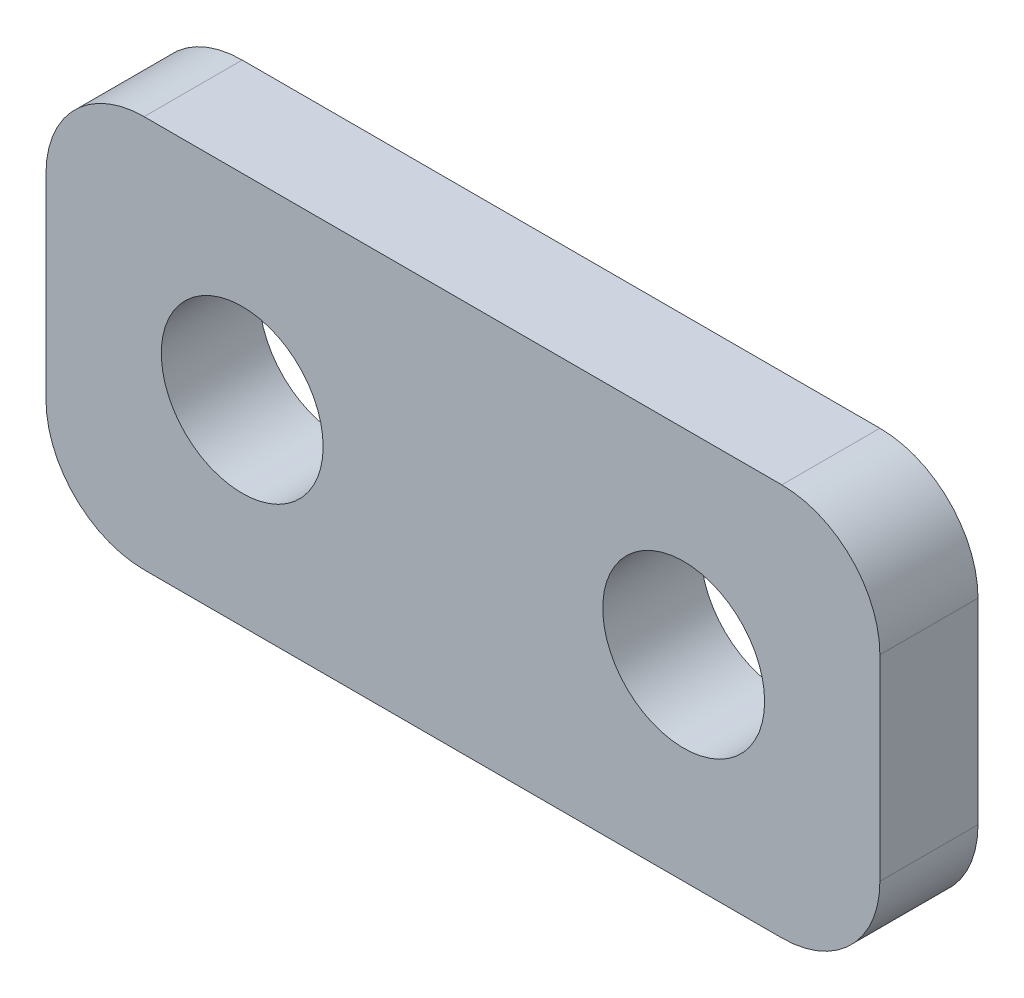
ISO-10303-21;
HEADER;
FILE_DESCRIPTION(('STEP AP214'),'2;1');
FILE_NAME('part.step','',(''),(''),'','','');
FILE_SCHEMA(('AUTOMOTIVE_DESIGN { 1 0 10303 214 1 1 1 1 }'));
ENDSEC;
DATA;
#1=APPLICATION_CONTEXT('core data for automotive mechanical design processes');
#2=APPLICATION_PROTOCOL_DEFINITION('international standard','automotive_design',2000,#1);
#3=PRODUCT_CONTEXT('',#1,'mechanical');
#4=PRODUCT('Part','Part','',(#3));
#5=PRODUCT_RELATED_PRODUCT_CATEGORY('part','',(#4));
#6=PRODUCT_DEFINITION_FORMATION('','',#4);
#7=PRODUCT_DEFINITION_CONTEXT('part definition',#1,'design');
#8=PRODUCT_DEFINITION('design','',#6,#7);
#9=PRODUCT_DEFINITION_SHAPE('','',#8);
#10=(LENGTH_UNIT() NAMED_UNIT(*) SI_UNIT(.MILLI.,.METRE.));
#11=(NAMED_UNIT(*) PLANE_ANGLE_UNIT() SI_UNIT($,.RADIAN.));
#12=(NAMED_UNIT(*) SI_UNIT($,.STERADIAN.) SOLID_ANGLE_UNIT());
#13=UNCERTAINTY_MEASURE_WITH_UNIT(LENGTH_MEASURE(1.E-05),#10,'distance_accuracy_value','');
#14=(GEOMETRIC_REPRESENTATION_CONTEXT(3) GLOBAL_UNCERTAINTY_ASSIGNED_CONTEXT((#13)) GLOBAL_UNIT_ASSIGNED_CONTEXT((#10,
#11,#12)) REPRESENTATION_CONTEXT('',''));
#15=CARTESIAN_POINT('',(0.,0.,0.));
#16=DIRECTION('',(0.,0.,1.));
#17=DIRECTION('',(1.,0.,0.));
#18=AXIS2_PLACEMENT_3D('',#15,#16,#17);
#19=CARTESIAN_POINT('',(8.5,4.,2.));
#20=DIRECTION('',(-1.,0.,0.));
#21=DIRECTION('',(0.,-1.,0.));
#22=AXIS2_PLACEMENT_3D('',#19,#20,#21);
#23=PLANE('',#22);
#24=DIRECTION('',(0.,1.,0.));
#25=VECTOR('',#24,1.);
#26=CARTESIAN_POINT('',(8.5,4.,2.));
#27=LINE('',#26,#25);
#28=CARTESIAN_POINT('',(8.5,-2.,2.));
#29=VERTEX_POINT('',#28);
#30=CARTESIAN_POINT('',(8.5,2.,2.));
#31=VERTEX_POINT('',#30);
#32=EDGE_CURVE('E127',#29,#31,#27,.T.);
#33=ORIENTED_EDGE('',*,*,#32,.F.);
#34=DIRECTION('',(0.,0.,-1.));
#35=VECTOR('',#34,1.);
#36=CARTESIAN_POINT('',(8.5,-2.,2.));
#37=LINE('',#36,#35);
#38=CARTESIAN_POINT('',(8.5,-2.,0.));
#39=VERTEX_POINT('',#38);
#40=EDGE_CURVE('E112',#29,#39,#37,.T.);
#41=ORIENTED_EDGE('',*,*,#40,.T.);
#42=DIRECTION('',(0.,1.,0.));
#43=VECTOR('',#42,1.);
#44=CARTESIAN_POINT('',(8.5,4.,0.));
#45=LINE('',#44,#43);
#46=CARTESIAN_POINT('',(8.5,2.,0.));
#47=VERTEX_POINT('',#46);
#48=EDGE_CURVE('E124',#39,#47,#45,.T.);
#49=ORIENTED_EDGE('',*,*,#48,.T.);
#50=DIRECTION('',(0.,0.,-1.));
#51=VECTOR('',#50,1.);
#52=CARTESIAN_POINT('',(8.5,2.,2.));
#53=LINE('',#52,#51);
#54=EDGE_CURVE('E129',#47,#31,#53,.F.);
#55=ORIENTED_EDGE('',*,*,#54,.T.);
#56=EDGE_LOOP('',(#33,#41,#49,#55));
#57=FACE_BOUND('',#56,.T.);
#58=ADVANCED_FACE('F41',(#57),#23,.F.);
#59=CARTESIAN_POINT('',(-8.5,4.,2.));
#60=DIRECTION('',(0.,-1.,0.));
#61=DIRECTION('',(0.,0.,-1.));
#62=AXIS2_PLACEMENT_3D('',#59,#60,#61);
#63=PLANE('',#62);
#64=DIRECTION('',(-1.,0.,0.));
#65=VECTOR('',#64,1.);
#66=CARTESIAN_POINT('',(-8.5,4.,2.));
#67=LINE('',#66,#65);
#68=CARTESIAN_POINT('',(6.5,4.,2.));
#69=VERTEX_POINT('',#68);
#70=CARTESIAN_POINT('',(-6.5,4.,2.));
#71=VERTEX_POINT('',#70);
#72=EDGE_CURVE('E171',#69,#71,#67,.T.);
#73=ORIENTED_EDGE('',*,*,#72,.F.);
#74=DIRECTION('',(0.,0.,-1.));
#75=VECTOR('',#74,1.);
#76=CARTESIAN_POINT('',(6.5,4.,2.));
#77=LINE('',#76,#75);
#78=CARTESIAN_POINT('',(6.5,4.,0.));
#79=VERTEX_POINT('',#78);
#80=EDGE_CURVE('E11',#69,#79,#77,.T.);
#81=ORIENTED_EDGE('',*,*,#80,.T.);
#82=DIRECTION('',(-1.,0.,0.));
#83=VECTOR('',#82,1.);
#84=CARTESIAN_POINT('',(-8.5,4.,0.));
#85=LINE('',#84,#83);
#86=CARTESIAN_POINT('',(-6.5,4.,0.));
#87=VERTEX_POINT('',#86);
#88=EDGE_CURVE('E134',#79,#87,#85,.T.);
#89=ORIENTED_EDGE('',*,*,#88,.T.);
#90=DIRECTION('',(0.,0.,-1.));
#91=VECTOR('',#90,1.);
#92=CARTESIAN_POINT('',(-6.5,4.,2.));
#93=LINE('',#92,#91);
#94=EDGE_CURVE('E49',#87,#71,#93,.F.);
#95=ORIENTED_EDGE('',*,*,#94,.T.);
#96=EDGE_LOOP('',(#73,#81,#89,#95));
#97=FACE_BOUND('',#96,.T.);
#98=ADVANCED_FACE('F170',(#97),#63,.F.);
#99=CARTESIAN_POINT('',(-8.5,4.,2.));
#100=DIRECTION('',(1.,0.,0.));
#101=DIRECTION('',(0.,1.,0.));
#102=AXIS2_PLACEMENT_3D('',#99,#100,#101);
#103=PLANE('',#102);
#104=DIRECTION('',(0.,-1.,0.));
#105=VECTOR('',#104,1.);
#106=CARTESIAN_POINT('',(-8.5,4.,0.));
#107=LINE('',#106,#105);
#108=CARTESIAN_POINT('',(-8.5,2.,0.));
#109=VERTEX_POINT('',#108);
#110=CARTESIAN_POINT('',(-8.5,-2.,0.));
#111=VERTEX_POINT('',#110);
#112=EDGE_CURVE('E138',#109,#111,#107,.T.);
#113=ORIENTED_EDGE('',*,*,#112,.T.);
#114=DIRECTION('',(0.,0.,-1.));
#115=VECTOR('',#114,1.);
#116=CARTESIAN_POINT('',(-8.5,-2.,2.));
#117=LINE('',#116,#115);
#118=CARTESIAN_POINT('',(-8.5,-2.,2.));
#119=VERTEX_POINT('',#118);
#120=EDGE_CURVE('E56',#111,#119,#117,.F.);
#121=ORIENTED_EDGE('',*,*,#120,.T.);
#122=DIRECTION('',(0.,-1.,0.));
#123=VECTOR('',#122,1.);
#124=CARTESIAN_POINT('',(-8.5,4.,2.));
#125=LINE('',#124,#123);
#126=CARTESIAN_POINT('',(-8.5,2.,2.));
#127=VERTEX_POINT('',#126);
#128=EDGE_CURVE('E177',#127,#119,#125,.T.);
#129=ORIENTED_EDGE('',*,*,#128,.F.);
#130=DIRECTION('',(0.,0.,-1.));
#131=VECTOR('',#130,1.);
#132=CARTESIAN_POINT('',(-8.5,2.,2.));
#133=LINE('',#132,#131);
#134=EDGE_CURVE('E164',#127,#109,#133,.T.);
#135=ORIENTED_EDGE('',*,*,#134,.T.);
#136=EDGE_LOOP('',(#113,#121,#129,#135));
#137=FACE_BOUND('',#136,.T.);
#138=ADVANCED_FACE('F181',(#137),#103,.F.);
#139=CARTESIAN_POINT('',(-8.5,-4.,2.));
#140=DIRECTION('',(0.,1.,0.));
#141=DIRECTION('',(0.,0.,1.));
#142=AXIS2_PLACEMENT_3D('',#139,#140,#141);
#143=PLANE('',#142);
#144=DIRECTION('',(1.,0.,0.));
#145=VECTOR('',#144,1.);
#146=CARTESIAN_POINT('',(-8.5,-4.,0.));
#147=LINE('',#146,#145);
#148=CARTESIAN_POINT('',(-6.5,-4.,0.));
#149=VERTEX_POINT('',#148);
#150=CARTESIAN_POINT('',(6.50000000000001,-4.,0.));
#151=VERTEX_POINT('',#150);
#152=EDGE_CURVE('E148',#149,#151,#147,.T.);
#153=ORIENTED_EDGE('',*,*,#152,.T.);
#154=DIRECTION('',(0.,0.,-1.));
#155=VECTOR('',#154,1.);
#156=CARTESIAN_POINT('',(6.50000000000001,-4.,2.));
#157=LINE('',#156,#155);
#158=CARTESIAN_POINT('',(6.50000000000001,-4.,2.));
#159=VERTEX_POINT('',#158);
#160=EDGE_CURVE('E113',#151,#159,#157,.F.);
#161=ORIENTED_EDGE('',*,*,#160,.T.);
#162=DIRECTION('',(1.,0.,0.));
#163=VECTOR('',#162,1.);
#164=CARTESIAN_POINT('',(-8.5,-4.,2.));
#165=LINE('',#164,#163);
#166=CARTESIAN_POINT('',(-6.5,-4.,2.));
#167=VERTEX_POINT('',#166);
#168=EDGE_CURVE('E144',#167,#159,#165,.T.);
#169=ORIENTED_EDGE('',*,*,#168,.F.);
#170=DIRECTION('',(0.,0.,-1.));
#171=VECTOR('',#170,1.);
#172=CARTESIAN_POINT('',(-6.5,-4.,2.));
#173=LINE('',#172,#171);
#174=EDGE_CURVE('E118',#167,#149,#173,.T.);
#175=ORIENTED_EDGE('',*,*,#174,.T.);
#176=EDGE_LOOP('',(#153,#161,#169,#175));
#177=FACE_BOUND('',#176,.T.);
#178=ADVANCED_FACE('F188',(#177),#143,.F.);
#179=CARTESIAN_POINT('',(0.,0.,2.));
#180=DIRECTION('',(0.,0.,1.));
#181=DIRECTION('',(1.,0.,0.));
#182=AXIS2_PLACEMENT_3D('',#179,#180,#181);
#183=PLANE('',#182);
#184=CARTESIAN_POINT('',(-4.5,0.,2.));
#185=DIRECTION('',(0.,0.,1.));
#186=DIRECTION('',(1.,0.,0.));
#187=AXIS2_PLACEMENT_3D('',#184,#185,#186);
#188=CIRCLE('',#187,1.64999999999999);
#189=CARTESIAN_POINT('',(-2.85000000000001,0.,2.));
#190=VERTEX_POINT('',#189);
#191=EDGE_CURVE('E196',#190,#190,#188,.T.);
#192=ORIENTED_EDGE('',*,*,#191,.F.);
#193=EDGE_LOOP('',(#192));
#194=FACE_BOUND('',#193,.T.);
#195=CARTESIAN_POINT('',(4.50000000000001,0.,2.));
#196=DIRECTION('',(0.,0.,1.));
#197=DIRECTION('',(1.,0.,0.));
#198=AXIS2_PLACEMENT_3D('',#195,#196,#197);
#199=CIRCLE('',#198,1.64999999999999);
#200=CARTESIAN_POINT('',(6.14999999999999,0.,2.));
#201=VERTEX_POINT('',#200);
#202=EDGE_CURVE('E141',#201,#201,#199,.T.);
#203=ORIENTED_EDGE('',*,*,#202,.F.);
#204=EDGE_LOOP('',(#203));
#205=FACE_BOUND('',#204,.T.);
#206=ORIENTED_EDGE('',*,*,#168,.T.);
#207=CARTESIAN_POINT('',(6.50000000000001,-2.,2.));
#208=DIRECTION('',(0.,0.,1.));
#209=DIRECTION('',(1.,0.,0.));
#210=AXIS2_PLACEMENT_3D('',#207,#208,#209);
#211=CIRCLE('',#210,2.);
#212=EDGE_CURVE('E162',#159,#29,#211,.T.);
#213=ORIENTED_EDGE('',*,*,#212,.T.);
#214=ORIENTED_EDGE('',*,*,#32,.T.);
#215=CARTESIAN_POINT('',(6.5,2.,2.));
#216=DIRECTION('',(0.,0.,1.));
#217=DIRECTION('',(1.,0.,0.));
#218=AXIS2_PLACEMENT_3D('',#215,#216,#217);
#219=CIRCLE('',#218,2.);
#220=EDGE_CURVE('E158',#31,#69,#219,.T.);
#221=ORIENTED_EDGE('',*,*,#220,.T.);
#222=ORIENTED_EDGE('',*,*,#72,.T.);
#223=CARTESIAN_POINT('',(-6.5,2.,2.));
#224=DIRECTION('',(0.,0.,1.));
#225=DIRECTION('',(1.,0.,0.));
#226=AXIS2_PLACEMENT_3D('',#223,#224,#225);
#227=CIRCLE('',#226,2.);
#228=EDGE_CURVE('E63',#71,#127,#227,.T.);
#229=ORIENTED_EDGE('',*,*,#228,.T.);
#230=ORIENTED_EDGE('',*,*,#128,.T.);
#231=CARTESIAN_POINT('',(-6.5,-2.,2.));
#232=DIRECTION('',(0.,0.,1.));
#233=DIRECTION('',(1.,0.,0.));
#234=AXIS2_PLACEMENT_3D('',#231,#232,#233);
#235=CIRCLE('',#234,2.);
#236=EDGE_CURVE('E160',#119,#167,#235,.T.);
#237=ORIENTED_EDGE('',*,*,#236,.T.);
#238=EDGE_LOOP('',(#206,#213,#214,#221,#222,#229,#230,#237));
#239=FACE_BOUND('',#238,.T.);
#240=ADVANCED_FACE('F175',(#194,#205,#239),#183,.T.);
#241=CARTESIAN_POINT('',(0.,0.,0.));
#242=DIRECTION('',(0.,0.,1.));
#243=DIRECTION('',(1.,0.,0.));
#244=AXIS2_PLACEMENT_3D('',#241,#242,#243);
#245=PLANE('',#244);
#246=CARTESIAN_POINT('',(-4.5,0.,0.));
#247=DIRECTION('',(0.,0.,1.));
#248=DIRECTION('',(1.,0.,0.));
#249=AXIS2_PLACEMENT_3D('',#246,#247,#248);
#250=CIRCLE('',#249,1.65);
#251=CARTESIAN_POINT('',(-2.85,0.,0.));
#252=VERTEX_POINT('',#251);
#253=EDGE_CURVE('E193',#252,#252,#250,.T.);
#254=ORIENTED_EDGE('',*,*,#253,.T.);
#255=EDGE_LOOP('',(#254));
#256=FACE_BOUND('',#255,.T.);
#257=CARTESIAN_POINT('',(4.50000000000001,0.,0.));
#258=DIRECTION('',(0.,0.,1.));
#259=DIRECTION('',(1.,0.,0.));
#260=AXIS2_PLACEMENT_3D('',#257,#258,#259);
#261=CIRCLE('',#260,1.65);
#262=CARTESIAN_POINT('',(6.15,0.,0.));
#263=VERTEX_POINT('',#262);
#264=EDGE_CURVE('E135',#263,#263,#261,.T.);
#265=ORIENTED_EDGE('',*,*,#264,.T.);
#266=EDGE_LOOP('',(#265));
#267=FACE_BOUND('',#266,.T.);
#268=ORIENTED_EDGE('',*,*,#48,.F.);
#269=CARTESIAN_POINT('',(6.50000000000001,-2.,0.));
#270=DIRECTION('',(0.,0.,1.));
#271=DIRECTION('',(1.,0.,0.));
#272=AXIS2_PLACEMENT_3D('',#269,#270,#271);
#273=CIRCLE('',#272,2.);
#274=EDGE_CURVE('E108',#39,#151,#273,.F.);
#275=ORIENTED_EDGE('',*,*,#274,.T.);
#276=ORIENTED_EDGE('',*,*,#152,.F.);
#277=CARTESIAN_POINT('',(-6.5,-2.,0.));
#278=DIRECTION('',(0.,0.,1.));
#279=DIRECTION('',(1.,0.,0.));
#280=AXIS2_PLACEMENT_3D('',#277,#278,#279);
#281=CIRCLE('',#280,2.);
#282=EDGE_CURVE('E119',#149,#111,#281,.F.);
#283=ORIENTED_EDGE('',*,*,#282,.T.);
#284=ORIENTED_EDGE('',*,*,#112,.F.);
#285=CARTESIAN_POINT('',(-6.5,2.,0.));
#286=DIRECTION('',(0.,0.,1.));
#287=DIRECTION('',(1.,0.,0.));
#288=AXIS2_PLACEMENT_3D('',#285,#286,#287);
#289=CIRCLE('',#288,2.);
#290=EDGE_CURVE('E128',#109,#87,#289,.F.);
#291=ORIENTED_EDGE('',*,*,#290,.T.);
#292=ORIENTED_EDGE('',*,*,#88,.F.);
#293=CARTESIAN_POINT('',(6.5,2.,0.));
#294=DIRECTION('',(0.,0.,1.));
#295=DIRECTION('',(1.,0.,0.));
#296=AXIS2_PLACEMENT_3D('',#293,#294,#295);
#297=CIRCLE('',#296,2.);
#298=EDGE_CURVE('E133',#79,#47,#297,.F.);
#299=ORIENTED_EDGE('',*,*,#298,.T.);
#300=EDGE_LOOP('',(#268,#275,#276,#283,#284,#291,#292,#299));
#301=FACE_BOUND('',#300,.T.);
#302=ADVANCED_FACE('F131',(#256,#267,#301),#245,.F.);
#303=CARTESIAN_POINT('',(4.50000000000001,0.,2.));
#304=DIRECTION('',(0.,0.,1.));
#305=DIRECTION('',(1.,0.,0.));
#306=AXIS2_PLACEMENT_3D('',#303,#304,#305);
#307=CYLINDRICAL_SURFACE('',#306,1.64999999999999);
#308=ORIENTED_EDGE('',*,*,#264,.F.);
#309=EDGE_LOOP('',(#308));
#310=FACE_BOUND('',#309,.T.);
#311=ORIENTED_EDGE('',*,*,#202,.T.);
#312=EDGE_LOOP('',(#311));
#313=FACE_BOUND('',#312,.T.);
#314=ADVANCED_FACE('F207',(#310,#313),#307,.F.);
#315=CARTESIAN_POINT('',(-4.5,0.,2.));
#316=DIRECTION('',(0.,0.,1.));
#317=DIRECTION('',(1.,0.,0.));
#318=AXIS2_PLACEMENT_3D('',#315,#316,#317);
#319=CYLINDRICAL_SURFACE('',#318,1.64999999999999);
#320=ORIENTED_EDGE('',*,*,#253,.F.);
#321=EDGE_LOOP('',(#320));
#322=FACE_BOUND('',#321,.T.);
#323=ORIENTED_EDGE('',*,*,#191,.T.);
#324=EDGE_LOOP('',(#323));
#325=FACE_BOUND('',#324,.T.);
#326=ADVANCED_FACE('F200',(#322,#325),#319,.F.);
#327=CARTESIAN_POINT('',(6.50000000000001,-2.,2.));
#328=DIRECTION('',(0.,0.,-1.));
#329=DIRECTION('',(-1.,0.,0.));
#330=AXIS2_PLACEMENT_3D('',#327,#328,#329);
#331=CYLINDRICAL_SURFACE('',#330,2.);
#332=ORIENTED_EDGE('',*,*,#212,.F.);
#333=ORIENTED_EDGE('',*,*,#160,.F.);
#334=ORIENTED_EDGE('',*,*,#274,.F.);
#335=ORIENTED_EDGE('',*,*,#40,.F.);
#336=EDGE_LOOP('',(#332,#333,#334,#335));
#337=FACE_BOUND('',#336,.T.);
#338=ADVANCED_FACE('F111',(#337),#331,.T.);
#339=CARTESIAN_POINT('',(-6.5,-2.,2.));
#340=DIRECTION('',(0.,0.,-1.));
#341=DIRECTION('',(-1.,0.,0.));
#342=AXIS2_PLACEMENT_3D('',#339,#340,#341);
#343=CYLINDRICAL_SURFACE('',#342,2.);
#344=ORIENTED_EDGE('',*,*,#236,.F.);
#345=ORIENTED_EDGE('',*,*,#120,.F.);
#346=ORIENTED_EDGE('',*,*,#282,.F.);
#347=ORIENTED_EDGE('',*,*,#174,.F.);
#348=EDGE_LOOP('',(#344,#345,#346,#347));
#349=FACE_BOUND('',#348,.T.);
#350=ADVANCED_FACE('F185',(#349),#343,.T.);
#351=CARTESIAN_POINT('',(6.5,2.,2.));
#352=DIRECTION('',(0.,0.,-1.));
#353=DIRECTION('',(-1.,0.,0.));
#354=AXIS2_PLACEMENT_3D('',#351,#352,#353);
#355=CYLINDRICAL_SURFACE('',#354,2.);
#356=ORIENTED_EDGE('',*,*,#220,.F.);
#357=ORIENTED_EDGE('',*,*,#54,.F.);
#358=ORIENTED_EDGE('',*,*,#298,.F.);
#359=ORIENTED_EDGE('',*,*,#80,.F.);
#360=EDGE_LOOP('',(#356,#357,#358,#359));
#361=FACE_BOUND('',#360,.T.);
#362=ADVANCED_FACE('F231',(#361),#355,.T.);
#363=CARTESIAN_POINT('',(-6.5,2.,2.));
#364=DIRECTION('',(0.,0.,-1.));
#365=DIRECTION('',(-1.,0.,0.));
#366=AXIS2_PLACEMENT_3D('',#363,#364,#365);
#367=CYLINDRICAL_SURFACE('',#366,2.);
#368=ORIENTED_EDGE('',*,*,#228,.F.);
#369=ORIENTED_EDGE('',*,*,#94,.F.);
#370=ORIENTED_EDGE('',*,*,#290,.F.);
#371=ORIENTED_EDGE('',*,*,#134,.F.);
#372=EDGE_LOOP('',(#368,#369,#370,#371));
#373=FACE_BOUND('',#372,.T.);
#374=ADVANCED_FACE('F43',(#373),#367,.T.);
#375=CLOSED_SHELL('',(#58,#98,#138,#178,#240,#302,#314,#326,#338,#350,#362,#374));
#376=MANIFOLD_SOLID_BREP('B2',#375);
#377=ADVANCED_BREP_SHAPE_REPRESENTATION('',(#18,#376),#14);
#378=SHAPE_DEFINITION_REPRESENTATION(#9,#377);
ENDSEC;
END-ISO-10303-21;
